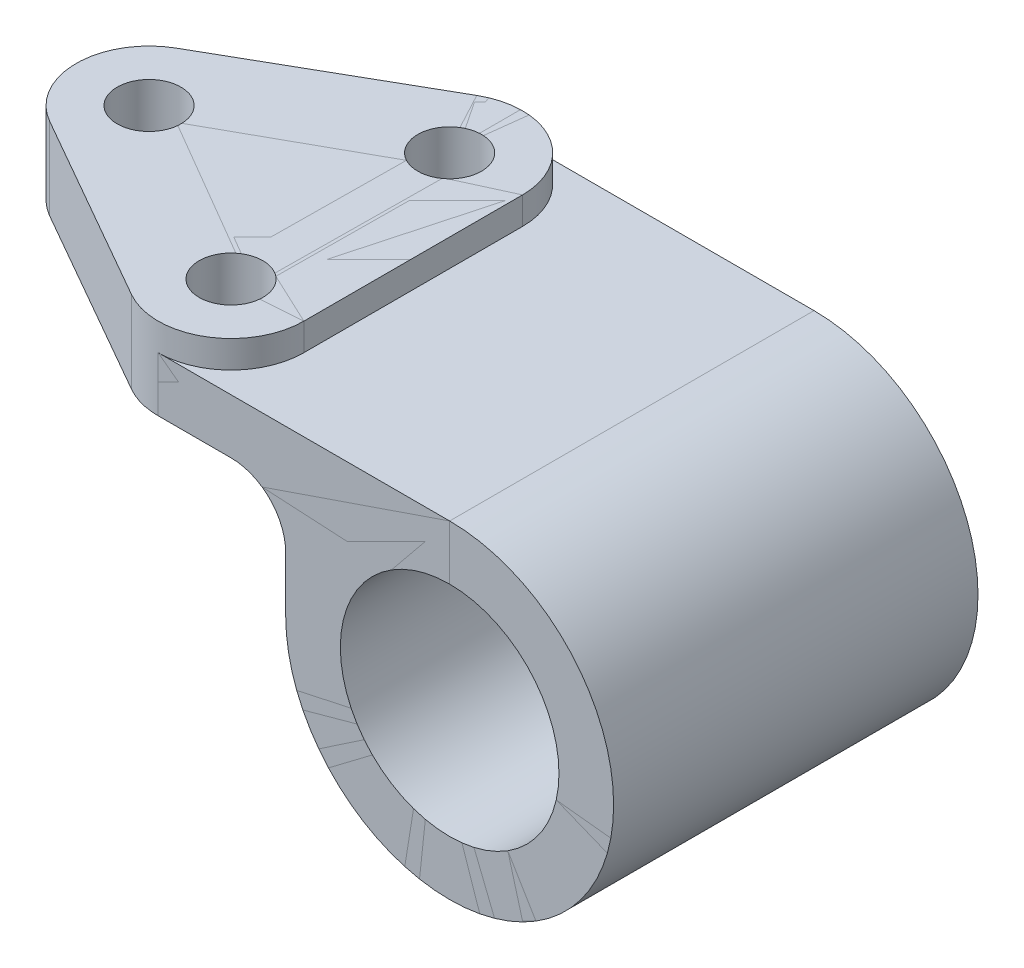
ISO-10303-21;
HEADER;
FILE_DESCRIPTION(('STEP AP214'),'2;1');
FILE_NAME('part.step','',(''),(''),'','','');
FILE_SCHEMA(('AUTOMOTIVE_DESIGN { 1 0 10303 214 1 1 1 1 }'));
ENDSEC;
DATA;
#1=APPLICATION_CONTEXT('core data for automotive mechanical design processes');
#2=APPLICATION_PROTOCOL_DEFINITION('international standard','automotive_design',2000,#1);
#3=PRODUCT_CONTEXT('',#1,'mechanical');
#4=PRODUCT('Part','Part','',(#3));
#5=PRODUCT_RELATED_PRODUCT_CATEGORY('part','',(#4));
#6=PRODUCT_DEFINITION_FORMATION('','',#4);
#7=PRODUCT_DEFINITION_CONTEXT('part definition',#1,'design');
#8=PRODUCT_DEFINITION('design','',#6,#7);
#9=PRODUCT_DEFINITION_SHAPE('','',#8);
#10=(LENGTH_UNIT() NAMED_UNIT(*) SI_UNIT(.MILLI.,.METRE.));
#11=(NAMED_UNIT(*) PLANE_ANGLE_UNIT() SI_UNIT($,.RADIAN.));
#12=(NAMED_UNIT(*) SI_UNIT($,.STERADIAN.) SOLID_ANGLE_UNIT());
#13=UNCERTAINTY_MEASURE_WITH_UNIT(LENGTH_MEASURE(1.E-05),#10,'distance_accuracy_value','');
#14=(GEOMETRIC_REPRESENTATION_CONTEXT(3) GLOBAL_UNCERTAINTY_ASSIGNED_CONTEXT((#13)) GLOBAL_UNIT_ASSIGNED_CONTEXT((#10,
#11,#12)) REPRESENTATION_CONTEXT('',''));
#15=CARTESIAN_POINT('',(0.,0.,0.));
#16=DIRECTION('',(0.,0.,1.));
#17=DIRECTION('',(1.,0.,0.));
#18=AXIS2_PLACEMENT_3D('',#15,#16,#17);
#19=CARTESIAN_POINT('',(-38.1,9.525,31.75));
#20=DIRECTION('',(0.,0.,-1.));
#21=DIRECTION('',(-1.,0.,0.));
#22=AXIS2_PLACEMENT_3D('',#19,#20,#21);
#23=PLANE('',#22);
#24=CARTESIAN_POINT('',(0.,0.,31.75));
#25=DIRECTION('',(0.,0.,1.));
#26=DIRECTION('',(1.,0.,0.));
#27=AXIS2_PLACEMENT_3D('',#24,#25,#26);
#28=CIRCLE('',#27,19.05);
#29=CARTESIAN_POINT('',(19.05,0.,31.75));
#30=VERTEX_POINT('',#29);
#31=EDGE_CURVE('E12',#30,#30,#28,.T.);
#32=ORIENTED_EDGE('',*,*,#31,.F.);
#33=EDGE_LOOP('',(#32));
#34=FACE_BOUND('',#33,.T.);
#35=DIRECTION('',(-1.,0.,0.));
#36=VECTOR('',#35,1.);
#37=CARTESIAN_POINT('',(-101.6,28.575,31.75));
#38=LINE('',#37,#36);
#39=CARTESIAN_POINT('',(0.,28.575,31.75));
#40=VERTEX_POINT('',#39);
#41=CARTESIAN_POINT('',(-50.8,28.575,31.75));
#42=VERTEX_POINT('',#41);
#43=EDGE_CURVE('E52',#40,#42,#38,.T.);
#44=ORIENTED_EDGE('',*,*,#43,.T.);
#45=DIRECTION('',(0.,1.,0.));
#46=VECTOR('',#45,1.);
#47=CARTESIAN_POINT('',(-50.8,-9.525,31.75));
#48=LINE('',#47,#46);
#49=CARTESIAN_POINT('',(-50.8,19.05,31.75));
#50=VERTEX_POINT('',#49);
#51=EDGE_CURVE('E62',#42,#50,#48,.F.);
#52=ORIENTED_EDGE('',*,*,#51,.T.);
#53=DIRECTION('',(1.,0.,0.));
#54=VECTOR('',#53,1.);
#55=CARTESIAN_POINT('',(-101.6,19.05,31.75));
#56=LINE('',#55,#54);
#57=CARTESIAN_POINT('',(-38.1000000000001,19.05,31.75));
#58=VERTEX_POINT('',#57);
#59=EDGE_CURVE('E88',#50,#58,#56,.T.);
#60=ORIENTED_EDGE('',*,*,#59,.T.);
#61=CARTESIAN_POINT('',(-38.1,9.525,31.75));
#62=DIRECTION('',(0.,0.,-1.));
#63=DIRECTION('',(-1.,0.,0.));
#64=AXIS2_PLACEMENT_3D('',#61,#62,#63);
#65=CIRCLE('',#64,9.525);
#66=CARTESIAN_POINT('',(-28.575,9.52499999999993,31.75));
#67=VERTEX_POINT('',#66);
#68=EDGE_CURVE('E83',#58,#67,#65,.T.);
#69=ORIENTED_EDGE('',*,*,#68,.T.);
#70=DIRECTION('',(0.,-1.,0.));
#71=VECTOR('',#70,1.);
#72=CARTESIAN_POINT('',(-28.575,9.52499999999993,31.75));
#73=LINE('',#72,#71);
#74=CARTESIAN_POINT('',(-28.575,0.,31.75));
#75=VERTEX_POINT('',#74);
#76=EDGE_CURVE('E77',#67,#75,#73,.T.);
#77=ORIENTED_EDGE('',*,*,#76,.T.);
#78=CARTESIAN_POINT('',(0.,0.,31.75));
#79=DIRECTION('',(0.,0.,1.));
#80=DIRECTION('',(1.,0.,0.));
#81=AXIS2_PLACEMENT_3D('',#78,#79,#80);
#82=CIRCLE('',#81,28.575);
#83=EDGE_CURVE('E75',#75,#40,#82,.T.);
#84=ORIENTED_EDGE('',*,*,#83,.T.);
#85=EDGE_LOOP('',(#44,#52,#60,#69,#77,#84));
#86=FACE_BOUND('',#85,.T.);
#87=ADVANCED_FACE('F47',(#34,#86),#23,.F.);
#88=OPEN_SHELL('',(#87));
#89=SHELL_BASED_SURFACE_MODEL('B2',(#88));
#90=CARTESIAN_POINT('',(-50.8,33.3375,-19.05));
#91=DIRECTION('',(0.,-1.,0.));
#92=DIRECTION('',(0.,0.,-1.));
#93=AXIS2_PLACEMENT_3D('',#90,#91,#92);
#94=PLANE('',#93);
#95=CARTESIAN_POINT('',(-84.1375,33.3375,0.));
#96=DIRECTION('',(0.,1.,0.));
#97=DIRECTION('',(0.,0.,1.));
#98=AXIS2_PLACEMENT_3D('',#95,#96,#97);
#99=CIRCLE('',#98,5.55625);
#100=CARTESIAN_POINT('',(-84.1375,33.3375,5.55625));
#101=VERTEX_POINT('',#100);
#102=EDGE_CURVE('E184',#101,#101,#99,.T.);
#103=ORIENTED_EDGE('',*,*,#102,.F.);
#104=EDGE_LOOP('',(#103));
#105=FACE_BOUND('',#104,.T.);
#106=CARTESIAN_POINT('',(-50.8,33.3375,-19.05));
#107=DIRECTION('',(0.,1.,0.));
#108=DIRECTION('',(0.,0.,1.));
#109=AXIS2_PLACEMENT_3D('',#106,#107,#108);
#110=CIRCLE('',#109,5.55625);
#111=CARTESIAN_POINT('',(-50.8,33.3375,-13.49375));
#112=VERTEX_POINT('',#111);
#113=EDGE_CURVE('E180',#112,#112,#110,.T.);
#114=ORIENTED_EDGE('',*,*,#113,.F.);
#115=EDGE_LOOP('',(#114));
#116=FACE_BOUND('',#115,.T.);
#117=CARTESIAN_POINT('',(-50.8,33.3375,19.05));
#118=DIRECTION('',(0.,1.,0.));
#119=DIRECTION('',(0.,0.,1.));
#120=AXIS2_PLACEMENT_3D('',#117,#118,#119);
#121=CIRCLE('',#120,5.55625);
#122=CARTESIAN_POINT('',(-50.8,33.3375,24.60625));
#123=VERTEX_POINT('',#122);
#124=EDGE_CURVE('E154',#123,#123,#121,.T.);
#125=ORIENTED_EDGE('',*,*,#124,.F.);
#126=EDGE_LOOP('',(#125));
#127=FACE_BOUND('',#126,.T.);
#128=CARTESIAN_POINT('',(-50.8,33.3375,-19.05));
#129=DIRECTION('',(0.,1.,0.));
#130=DIRECTION('',(0.,0.,-1.));
#131=AXIS2_PLACEMENT_3D('',#128,#129,#130);
#132=CIRCLE('',#131,12.7);
#133=CARTESIAN_POINT('',(-38.1,33.3375,-19.05));
#134=VERTEX_POINT('',#133);
#135=CARTESIAN_POINT('',(-57.1009645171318,33.3375,-30.0766879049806));
#136=VERTEX_POINT('',#135);
#137=EDGE_CURVE('E134',#134,#136,#132,.T.);
#138=ORIENTED_EDGE('',*,*,#137,.T.);
#139=DIRECTION('',(-0.868243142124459,0.,0.496138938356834));
#140=VECTOR('',#139,1.);
#141=CARTESIAN_POINT('',(-90.4384645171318,33.3375,-11.0266879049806));
#142=LINE('',#141,#140);
#143=CARTESIAN_POINT('',(-90.4384645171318,33.3375,-11.0266879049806));
#144=VERTEX_POINT('',#143);
#145=EDGE_CURVE('E151',#136,#144,#142,.T.);
#146=ORIENTED_EDGE('',*,*,#145,.T.);
#147=CARTESIAN_POINT('',(-84.1375,33.3375,0.));
#148=DIRECTION('',(0.,1.,0.));
#149=DIRECTION('',(0.,0.,1.));
#150=AXIS2_PLACEMENT_3D('',#147,#148,#149);
#151=CIRCLE('',#150,12.7);
#152=CARTESIAN_POINT('',(-90.4384645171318,33.3375,11.0266879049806));
#153=VERTEX_POINT('',#152);
#154=EDGE_CURVE('E157',#144,#153,#151,.T.);
#155=ORIENTED_EDGE('',*,*,#154,.T.);
#156=DIRECTION('',(0.868243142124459,0.,0.496138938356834));
#157=VECTOR('',#156,1.);
#158=CARTESIAN_POINT('',(-57.1009645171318,33.3375,30.0766879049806));
#159=LINE('',#158,#157);
#160=CARTESIAN_POINT('',(-57.1009645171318,33.3375,30.0766879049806));
#161=VERTEX_POINT('',#160);
#162=EDGE_CURVE('E162',#153,#161,#159,.T.);
#163=ORIENTED_EDGE('',*,*,#162,.T.);
#164=CARTESIAN_POINT('',(-50.8,33.3375,19.05));
#165=DIRECTION('',(0.,1.,0.));
#166=DIRECTION('',(0.,0.,1.));
#167=AXIS2_PLACEMENT_3D('',#164,#165,#166);
#168=CIRCLE('',#167,12.7);
#169=CARTESIAN_POINT('',(-38.1,33.3375,19.05));
#170=VERTEX_POINT('',#169);
#171=EDGE_CURVE('E130',#161,#170,#168,.T.);
#172=ORIENTED_EDGE('',*,*,#171,.T.);
#173=DIRECTION('',(0.,0.,-1.));
#174=VECTOR('',#173,1.);
#175=CARTESIAN_POINT('',(-38.1,33.3375,-19.05));
#176=LINE('',#175,#174);
#177=EDGE_CURVE('E45',#170,#134,#176,.T.);
#178=ORIENTED_EDGE('',*,*,#177,.T.);
#179=EDGE_LOOP('',(#138,#146,#155,#163,#172,#178));
#180=FACE_BOUND('',#179,.T.);
#181=ADVANCED_FACE('F125',(#105,#116,#127,#180),#94,.F.);
#182=OPEN_SHELL('',(#181));
#183=SHELL_BASED_SURFACE_MODEL('B6',(#182));
#184=CARTESIAN_POINT('',(-38.1,9.525,31.75));
#185=DIRECTION('',(0.,0.,-1.));
#186=DIRECTION('',(-1.,0.,0.));
#187=AXIS2_PLACEMENT_3D('',#184,#185,#186);
#188=CYLINDRICAL_SURFACE('',#187,9.525);
#189=CARTESIAN_POINT('',(-38.1,9.525,-31.75));
#190=DIRECTION('',(0.,0.,-1.));
#191=DIRECTION('',(-1.,0.,0.));
#192=AXIS2_PLACEMENT_3D('',#189,#190,#191);
#193=CIRCLE('',#192,9.525);
#194=CARTESIAN_POINT('',(-38.1000000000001,19.05,-31.75));
#195=VERTEX_POINT('',#194);
#196=CARTESIAN_POINT('',(-28.575,9.52499999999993,-31.75));
#197=VERTEX_POINT('',#196);
#198=EDGE_CURVE('E387',#195,#197,#193,.T.);
#199=ORIENTED_EDGE('',*,*,#198,.T.);
#200=DIRECTION('',(0.,0.,-1.));
#201=VECTOR('',#200,1.);
#202=CARTESIAN_POINT('',(-28.575,9.52499999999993,31.75));
#203=LINE('',#202,#201);
#204=CARTESIAN_POINT('',(-28.575,9.52499999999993,31.75));
#205=VERTEX_POINT('',#204);
#206=EDGE_CURVE('E319',#205,#197,#203,.T.);
#207=ORIENTED_EDGE('',*,*,#206,.F.);
#208=CARTESIAN_POINT('',(-38.1,9.525,31.75));
#209=DIRECTION('',(0.,0.,-1.));
#210=DIRECTION('',(-1.,0.,0.));
#211=AXIS2_PLACEMENT_3D('',#208,#209,#210);
#212=CIRCLE('',#211,9.525);
#213=CARTESIAN_POINT('',(-38.1000000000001,19.05,31.75));
#214=VERTEX_POINT('',#213);
#215=EDGE_CURVE('E336',#214,#205,#212,.T.);
#216=ORIENTED_EDGE('',*,*,#215,.F.);
#217=DIRECTION('',(0.,0.,-1.));
#218=VECTOR('',#217,1.);
#219=CARTESIAN_POINT('',(-38.1000000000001,19.05,31.75));
#220=LINE('',#219,#218);
#221=EDGE_CURVE('E342',#214,#195,#220,.T.);
#222=ORIENTED_EDGE('',*,*,#221,.T.);
#223=EDGE_LOOP('',(#199,#207,#216,#222));
#224=FACE_BOUND('',#223,.T.);
#225=ADVANCED_FACE('F210',(#224),#188,.F.);
#226=CARTESIAN_POINT('',(-28.575,9.52499999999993,31.75));
#227=DIRECTION('',(1.,0.,0.));
#228=DIRECTION('',(0.,0.,-1.));
#229=AXIS2_PLACEMENT_3D('',#226,#227,#228);
#230=PLANE('',#229);
#231=DIRECTION('',(0.,-1.,0.));
#232=VECTOR('',#231,1.);
#233=CARTESIAN_POINT('',(-28.575,9.52499999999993,-31.75));
#234=LINE('',#233,#232);
#235=CARTESIAN_POINT('',(-28.575,0.,-31.75));
#236=VERTEX_POINT('',#235);
#237=EDGE_CURVE('E338',#197,#236,#234,.T.);
#238=ORIENTED_EDGE('',*,*,#237,.T.);
#239=DIRECTION('',(0.,0.,-1.));
#240=VECTOR('',#239,1.);
#241=CARTESIAN_POINT('',(-28.575,0.,31.75));
#242=LINE('',#241,#240);
#243=CARTESIAN_POINT('',(-28.575,0.,31.75));
#244=VERTEX_POINT('',#243);
#245=EDGE_CURVE('E345',#244,#236,#242,.T.);
#246=ORIENTED_EDGE('',*,*,#245,.F.);
#247=DIRECTION('',(0.,-1.,0.));
#248=VECTOR('',#247,1.);
#249=CARTESIAN_POINT('',(-28.575,9.52499999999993,31.75));
#250=LINE('',#249,#248);
#251=EDGE_CURVE('E260',#205,#244,#250,.T.);
#252=ORIENTED_EDGE('',*,*,#251,.F.);
#253=ORIENTED_EDGE('',*,*,#206,.T.);
#254=EDGE_LOOP('',(#238,#246,#252,#253));
#255=FACE_BOUND('',#254,.T.);
#256=ADVANCED_FACE('F415',(#255),#230,.F.);
#257=CARTESIAN_POINT('',(0.,0.,31.75));
#258=DIRECTION('',(0.,0.,-1.));
#259=DIRECTION('',(-1.,0.,0.));
#260=AXIS2_PLACEMENT_3D('',#257,#258,#259);
#261=CYLINDRICAL_SURFACE('',#260,28.575);
#262=CARTESIAN_POINT('',(0.,0.,-31.75));
#263=DIRECTION('',(0.,0.,1.));
#264=DIRECTION('',(1.,0.,0.));
#265=AXIS2_PLACEMENT_3D('',#262,#263,#264);
#266=CIRCLE('',#265,28.575);
#267=CARTESIAN_POINT('',(0.,28.575,-31.75));
#268=VERTEX_POINT('',#267);
#269=EDGE_CURVE('E245',#236,#268,#266,.T.);
#270=ORIENTED_EDGE('',*,*,#269,.T.);
#271=DIRECTION('',(0.,0.,-1.));
#272=VECTOR('',#271,1.);
#273=CARTESIAN_POINT('',(0.,28.575,31.75));
#274=LINE('',#273,#272);
#275=CARTESIAN_POINT('',(0.,28.575,31.75));
#276=VERTEX_POINT('',#275);
#277=EDGE_CURVE('E334',#276,#268,#274,.T.);
#278=ORIENTED_EDGE('',*,*,#277,.F.);
#279=CARTESIAN_POINT('',(0.,0.,31.75));
#280=DIRECTION('',(0.,0.,1.));
#281=DIRECTION('',(1.,0.,0.));
#282=AXIS2_PLACEMENT_3D('',#279,#280,#281);
#283=CIRCLE('',#282,28.575);
#284=EDGE_CURVE('E408',#244,#276,#283,.T.);
#285=ORIENTED_EDGE('',*,*,#284,.F.);
#286=ORIENTED_EDGE('',*,*,#245,.T.);
#287=EDGE_LOOP('',(#270,#278,#285,#286));
#288=FACE_BOUND('',#287,.T.);
#289=ADVANCED_FACE('F418',(#288),#261,.T.);
#290=CARTESIAN_POINT('',(-101.6,28.575,31.75));
#291=DIRECTION('',(0.,-1.,0.));
#292=DIRECTION('',(0.,0.,-1.));
#293=AXIS2_PLACEMENT_3D('',#290,#291,#292);
#294=PLANE('',#293);
#295=DIRECTION('',(-1.,0.,0.));
#296=VECTOR('',#295,1.);
#297=CARTESIAN_POINT('',(-101.6,28.575,-31.75));
#298=LINE('',#297,#296);
#299=CARTESIAN_POINT('',(-50.8,28.575,-31.75));
#300=VERTEX_POINT('',#299);
#301=EDGE_CURVE('E314',#268,#300,#298,.T.);
#302=ORIENTED_EDGE('',*,*,#301,.T.);
#303=CARTESIAN_POINT('',(-50.8,28.575,-19.05));
#304=DIRECTION('',(0.,-1.,0.));
#305=DIRECTION('',(0.,0.,-1.));
#306=AXIS2_PLACEMENT_3D('',#303,#304,#305);
#307=CIRCLE('',#306,12.7);
#308=CARTESIAN_POINT('',(-38.1,28.575,-19.05));
#309=VERTEX_POINT('',#308);
#310=EDGE_CURVE('E323',#309,#300,#307,.F.);
#311=ORIENTED_EDGE('',*,*,#310,.F.);
#312=DIRECTION('',(0.,0.,-1.));
#313=VECTOR('',#312,1.);
#314=CARTESIAN_POINT('',(-38.1,28.575,-19.05));
#315=LINE('',#314,#313);
#316=CARTESIAN_POINT('',(-38.1,28.575,19.05));
#317=VERTEX_POINT('',#316);
#318=EDGE_CURVE('E373',#317,#309,#315,.T.);
#319=ORIENTED_EDGE('',*,*,#318,.F.);
#320=CARTESIAN_POINT('',(-50.8,28.575,19.05));
#321=DIRECTION('',(0.,-1.,0.));
#322=DIRECTION('',(0.,0.,-1.));
#323=AXIS2_PLACEMENT_3D('',#320,#321,#322);
#324=CIRCLE('',#323,12.7);
#325=CARTESIAN_POINT('',(-50.8,28.575,31.75));
#326=VERTEX_POINT('',#325);
#327=EDGE_CURVE('E398',#326,#317,#324,.F.);
#328=ORIENTED_EDGE('',*,*,#327,.F.);
#329=DIRECTION('',(-1.,0.,0.));
#330=VECTOR('',#329,1.);
#331=CARTESIAN_POINT('',(-101.6,28.575,31.75));
#332=LINE('',#331,#330);
#333=EDGE_CURVE('E410',#276,#326,#332,.T.);
#334=ORIENTED_EDGE('',*,*,#333,.F.);
#335=ORIENTED_EDGE('',*,*,#277,.T.);
#336=EDGE_LOOP('',(#302,#311,#319,#328,#334,#335));
#337=FACE_BOUND('',#336,.T.);
#338=ADVANCED_FACE('F332',(#337),#294,.F.);
#339=CARTESIAN_POINT('',(-101.6,19.05,31.75));
#340=DIRECTION('',(0.,1.,0.));
#341=DIRECTION('',(0.,0.,1.));
#342=AXIS2_PLACEMENT_3D('',#339,#340,#341);
#343=PLANE('',#342);
#344=CARTESIAN_POINT('',(-84.1375,19.05,0.));
#345=DIRECTION('',(0.,1.,0.));
#346=DIRECTION('',(0.,0.,1.));
#347=AXIS2_PLACEMENT_3D('',#344,#345,#346);
#348=CIRCLE('',#347,5.55625);
#349=CARTESIAN_POINT('',(-84.1375,19.05,5.55625));
#350=VERTEX_POINT('',#349);
#351=EDGE_CURVE('E475',#350,#350,#348,.T.);
#352=ORIENTED_EDGE('',*,*,#351,.T.);
#353=EDGE_LOOP('',(#352));
#354=FACE_BOUND('',#353,.T.);
#355=CARTESIAN_POINT('',(-50.8,19.05,-19.05));
#356=DIRECTION('',(0.,1.,0.));
#357=DIRECTION('',(0.,0.,1.));
#358=AXIS2_PLACEMENT_3D('',#355,#356,#357);
#359=CIRCLE('',#358,5.55625);
#360=CARTESIAN_POINT('',(-50.8,19.05,-13.49375));
#361=VERTEX_POINT('',#360);
#362=EDGE_CURVE('E481',#361,#361,#359,.T.);
#363=ORIENTED_EDGE('',*,*,#362,.T.);
#364=EDGE_LOOP('',(#363));
#365=FACE_BOUND('',#364,.T.);
#366=CARTESIAN_POINT('',(-50.8,19.05,19.05));
#367=DIRECTION('',(0.,1.,0.));
#368=DIRECTION('',(0.,0.,1.));
#369=AXIS2_PLACEMENT_3D('',#366,#367,#368);
#370=CIRCLE('',#369,5.55625);
#371=CARTESIAN_POINT('',(-50.8,19.05,24.60625));
#372=VERTEX_POINT('',#371);
#373=EDGE_CURVE('E376',#372,#372,#370,.T.);
#374=ORIENTED_EDGE('',*,*,#373,.T.);
#375=EDGE_LOOP('',(#374));
#376=FACE_BOUND('',#375,.T.);
#377=DIRECTION('',(1.,0.,0.));
#378=VECTOR('',#377,1.);
#379=CARTESIAN_POINT('',(-101.6,19.05,31.75));
#380=LINE('',#379,#378);
#381=CARTESIAN_POINT('',(-50.8,19.05,31.75));
#382=VERTEX_POINT('',#381);
#383=EDGE_CURVE('E226',#382,#214,#380,.T.);
#384=ORIENTED_EDGE('',*,*,#383,.F.);
#385=CARTESIAN_POINT('',(-50.8,19.05,19.05));
#386=DIRECTION('',(0.,1.,0.));
#387=DIRECTION('',(0.,0.,1.));
#388=AXIS2_PLACEMENT_3D('',#385,#386,#387);
#389=CIRCLE('',#388,12.7);
#390=CARTESIAN_POINT('',(-57.1009645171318,19.05,30.0766879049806));
#391=VERTEX_POINT('',#390);
#392=EDGE_CURVE('E330',#382,#391,#389,.F.);
#393=ORIENTED_EDGE('',*,*,#392,.T.);
#394=DIRECTION('',(-0.868243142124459,0.,-0.496138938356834));
#395=VECTOR('',#394,1.);
#396=CARTESIAN_POINT('',(-89.9255799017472,19.05,11.3197648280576));
#397=LINE('',#396,#395);
#398=CARTESIAN_POINT('',(-90.4384645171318,19.05,11.0266879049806));
#399=VERTEX_POINT('',#398);
#400=EDGE_CURVE('E123',#391,#399,#397,.T.);
#401=ORIENTED_EDGE('',*,*,#400,.T.);
#402=CARTESIAN_POINT('',(-84.1375,19.05,0.));
#403=DIRECTION('',(0.,1.,0.));
#404=DIRECTION('',(0.,0.,1.));
#405=AXIS2_PLACEMENT_3D('',#402,#403,#404);
#406=CIRCLE('',#405,12.7);
#407=CARTESIAN_POINT('',(-90.4384645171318,19.05,-11.0266879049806));
#408=VERTEX_POINT('',#407);
#409=EDGE_CURVE('E218',#399,#408,#406,.F.);
#410=ORIENTED_EDGE('',*,*,#409,.T.);
#411=DIRECTION('',(0.868243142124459,0.,-0.496138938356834));
#412=VECTOR('',#411,1.);
#413=CARTESIAN_POINT('',(-117.279426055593,19.05,4.3110044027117));
#414=LINE('',#413,#412);
#415=CARTESIAN_POINT('',(-57.1009645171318,19.05,-30.0766879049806));
#416=VERTEX_POINT('',#415);
#417=EDGE_CURVE('E349',#408,#416,#414,.T.);
#418=ORIENTED_EDGE('',*,*,#417,.T.);
#419=CARTESIAN_POINT('',(-50.8,19.05,-19.05));
#420=DIRECTION('',(0.,1.,0.));
#421=DIRECTION('',(0.,0.,1.));
#422=AXIS2_PLACEMENT_3D('',#419,#420,#421);
#423=CIRCLE('',#422,12.7);
#424=CARTESIAN_POINT('',(-50.8,19.05,-31.75));
#425=VERTEX_POINT('',#424);
#426=EDGE_CURVE('E375',#416,#425,#423,.F.);
#427=ORIENTED_EDGE('',*,*,#426,.T.);
#428=DIRECTION('',(1.,0.,0.));
#429=VECTOR('',#428,1.);
#430=CARTESIAN_POINT('',(-101.6,19.05,-31.75));
#431=LINE('',#430,#429);
#432=EDGE_CURVE('E252',#425,#195,#431,.T.);
#433=ORIENTED_EDGE('',*,*,#432,.T.);
#434=ORIENTED_EDGE('',*,*,#221,.F.);
#435=EDGE_LOOP('',(#384,#393,#401,#410,#418,#427,#433,#434));
#436=FACE_BOUND('',#435,.T.);
#437=ADVANCED_FACE('F353',(#354,#365,#376,#436),#343,.F.);
#438=CARTESIAN_POINT('',(-38.1,9.525,31.75));
#439=DIRECTION('',(0.,0.,-1.));
#440=DIRECTION('',(-1.,0.,0.));
#441=AXIS2_PLACEMENT_3D('',#438,#439,#440);
#442=PLANE('',#441);
#443=CARTESIAN_POINT('',(0.,0.,31.75));
#444=DIRECTION('',(0.,0.,1.));
#445=DIRECTION('',(1.,0.,0.));
#446=AXIS2_PLACEMENT_3D('',#443,#444,#445);
#447=CIRCLE('',#446,19.05);
#448=CARTESIAN_POINT('',(19.05,0.,31.75));
#449=VERTEX_POINT('',#448);
#450=EDGE_CURVE('E465',#449,#449,#447,.T.);
#451=ORIENTED_EDGE('',*,*,#450,.F.);
#452=EDGE_LOOP('',(#451));
#453=FACE_BOUND('',#452,.T.);
#454=ORIENTED_EDGE('',*,*,#333,.T.);
#455=DIRECTION('',(0.,1.,0.));
#456=VECTOR('',#455,1.);
#457=CARTESIAN_POINT('',(-50.8,-9.525,31.75));
#458=LINE('',#457,#456);
#459=EDGE_CURVE('E318',#326,#382,#458,.F.);
#460=ORIENTED_EDGE('',*,*,#459,.T.);
#461=ORIENTED_EDGE('',*,*,#383,.T.);
#462=ORIENTED_EDGE('',*,*,#215,.T.);
#463=ORIENTED_EDGE('',*,*,#251,.T.);
#464=ORIENTED_EDGE('',*,*,#284,.T.);
#465=EDGE_LOOP('',(#454,#460,#461,#462,#463,#464));
#466=FACE_BOUND('',#465,.T.);
#467=ADVANCED_FACE('F419',(#453,#466),#442,.F.);
#468=CARTESIAN_POINT('',(-38.1,9.525,-31.75));
#469=DIRECTION('',(0.,0.,-1.));
#470=DIRECTION('',(-1.,0.,0.));
#471=AXIS2_PLACEMENT_3D('',#468,#469,#470);
#472=PLANE('',#471);
#473=CARTESIAN_POINT('',(0.,0.,-31.75));
#474=DIRECTION('',(0.,0.,1.));
#475=DIRECTION('',(1.,0.,0.));
#476=AXIS2_PLACEMENT_3D('',#473,#474,#475);
#477=CIRCLE('',#476,19.05);
#478=CARTESIAN_POINT('',(19.05,0.,-31.75));
#479=VERTEX_POINT('',#478);
#480=EDGE_CURVE('E467',#479,#479,#477,.T.);
#481=ORIENTED_EDGE('',*,*,#480,.T.);
#482=EDGE_LOOP('',(#481));
#483=FACE_BOUND('',#482,.T.);
#484=DIRECTION('',(0.,1.,0.));
#485=VECTOR('',#484,1.);
#486=CARTESIAN_POINT('',(-50.8,-9.525,-31.75));
#487=LINE('',#486,#485);
#488=EDGE_CURVE('E310',#300,#425,#487,.F.);
#489=ORIENTED_EDGE('',*,*,#488,.F.);
#490=ORIENTED_EDGE('',*,*,#301,.F.);
#491=ORIENTED_EDGE('',*,*,#269,.F.);
#492=ORIENTED_EDGE('',*,*,#237,.F.);
#493=ORIENTED_EDGE('',*,*,#198,.F.);
#494=ORIENTED_EDGE('',*,*,#432,.F.);
#495=EDGE_LOOP('',(#489,#490,#491,#492,#493,#494));
#496=FACE_BOUND('',#495,.T.);
#497=ADVANCED_FACE('F312',(#483,#496),#472,.T.);
#498=CARTESIAN_POINT('',(-50.8,-28.576,-19.05));
#499=DIRECTION('',(0.,1.,0.));
#500=DIRECTION('',(0.,0.,1.));
#501=AXIS2_PLACEMENT_3D('',#498,#499,#500);
#502=CYLINDRICAL_SURFACE('',#501,12.7);
#503=ORIENTED_EDGE('',*,*,#310,.T.);
#504=ORIENTED_EDGE('',*,*,#488,.T.);
#505=ORIENTED_EDGE('',*,*,#426,.F.);
#506=DIRECTION('',(0.,1.,0.));
#507=VECTOR('',#506,1.);
#508=CARTESIAN_POINT('',(-57.1009645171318,-28.576,-30.0766879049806));
#509=LINE('',#508,#507);
#510=CARTESIAN_POINT('',(-57.1009645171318,33.3375,-30.0766879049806));
#511=VERTEX_POINT('',#510);
#512=EDGE_CURVE('E329',#416,#511,#509,.T.);
#513=ORIENTED_EDGE('',*,*,#512,.T.);
#514=CARTESIAN_POINT('',(-50.8,33.3375,-19.05));
#515=DIRECTION('',(0.,1.,0.));
#516=DIRECTION('',(0.,0.,-1.));
#517=AXIS2_PLACEMENT_3D('',#514,#515,#516);
#518=CIRCLE('',#517,12.7);
#519=CARTESIAN_POINT('',(-38.1,33.3375,-19.05));
#520=VERTEX_POINT('',#519);
#521=EDGE_CURVE('E368',#520,#511,#518,.T.);
#522=ORIENTED_EDGE('',*,*,#521,.F.);
#523=DIRECTION('',(0.,1.,0.));
#524=VECTOR('',#523,1.);
#525=CARTESIAN_POINT('',(-38.1,-28.576,-19.05));
#526=LINE('',#525,#524);
#527=EDGE_CURVE('E326',#309,#520,#526,.T.);
#528=ORIENTED_EDGE('',*,*,#527,.F.);
#529=EDGE_LOOP('',(#503,#504,#505,#513,#522,#528));
#530=FACE_BOUND('',#529,.T.);
#531=ADVANCED_FACE('F324',(#530),#502,.T.);
#532=CARTESIAN_POINT('',(-38.1,-28.576,-19.05));
#533=DIRECTION('',(1.,0.,0.));
#534=DIRECTION('',(0.,0.,-1.));
#535=AXIS2_PLACEMENT_3D('',#532,#533,#534);
#536=PLANE('',#535);
#537=DIRECTION('',(0.,1.,0.));
#538=VECTOR('',#537,1.);
#539=CARTESIAN_POINT('',(-38.1,-28.576,19.05));
#540=LINE('',#539,#538);
#541=CARTESIAN_POINT('',(-38.1,33.3375,19.05));
#542=VERTEX_POINT('',#541);
#543=EDGE_CURVE('E400',#317,#542,#540,.T.);
#544=ORIENTED_EDGE('',*,*,#543,.F.);
#545=ORIENTED_EDGE('',*,*,#318,.T.);
#546=ORIENTED_EDGE('',*,*,#527,.T.);
#547=DIRECTION('',(0.,0.,-1.));
#548=VECTOR('',#547,1.);
#549=CARTESIAN_POINT('',(-38.1,33.3375,-19.05));
#550=LINE('',#549,#548);
#551=EDGE_CURVE('E384',#542,#520,#550,.T.);
#552=ORIENTED_EDGE('',*,*,#551,.F.);
#553=EDGE_LOOP('',(#544,#545,#546,#552));
#554=FACE_BOUND('',#553,.T.);
#555=ADVANCED_FACE('F433',(#554),#536,.T.);
#556=CARTESIAN_POINT('',(-50.8,-28.576,19.05));
#557=DIRECTION('',(0.,1.,0.));
#558=DIRECTION('',(0.,0.,1.));
#559=AXIS2_PLACEMENT_3D('',#556,#557,#558);
#560=CYLINDRICAL_SURFACE('',#559,12.7);
#561=DIRECTION('',(0.,1.,0.));
#562=VECTOR('',#561,1.);
#563=CARTESIAN_POINT('',(-57.1009645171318,-28.576,30.0766879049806));
#564=LINE('',#563,#562);
#565=CARTESIAN_POINT('',(-57.1009645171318,33.3375,30.0766879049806));
#566=VERTEX_POINT('',#565);
#567=EDGE_CURVE('E403',#391,#566,#564,.T.);
#568=ORIENTED_EDGE('',*,*,#567,.F.);
#569=ORIENTED_EDGE('',*,*,#392,.F.);
#570=ORIENTED_EDGE('',*,*,#459,.F.);
#571=ORIENTED_EDGE('',*,*,#327,.T.);
#572=ORIENTED_EDGE('',*,*,#543,.T.);
#573=CARTESIAN_POINT('',(-50.8,33.3375,19.05));
#574=DIRECTION('',(0.,1.,0.));
#575=DIRECTION('',(0.,0.,1.));
#576=AXIS2_PLACEMENT_3D('',#573,#574,#575);
#577=CIRCLE('',#576,12.7);
#578=EDGE_CURVE('E388',#566,#542,#577,.T.);
#579=ORIENTED_EDGE('',*,*,#578,.F.);
#580=EDGE_LOOP('',(#568,#569,#570,#571,#572,#579));
#581=FACE_BOUND('',#580,.T.);
#582=ADVANCED_FACE('F423',(#581),#560,.T.);
#583=CARTESIAN_POINT('',(-57.1009645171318,-28.576,30.0766879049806));
#584=DIRECTION('',(-0.496138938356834,0.,0.868243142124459));
#585=DIRECTION('',(0.868243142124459,0.,0.496138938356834));
#586=AXIS2_PLACEMENT_3D('',#583,#584,#585);
#587=PLANE('',#586);
#588=DIRECTION('',(0.,1.,0.));
#589=VECTOR('',#588,1.);
#590=CARTESIAN_POINT('',(-90.4384645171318,-28.576,11.0266879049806));
#591=LINE('',#590,#589);
#592=CARTESIAN_POINT('',(-90.4384645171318,33.3375,11.0266879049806));
#593=VERTEX_POINT('',#592);
#594=EDGE_CURVE('E360',#399,#593,#591,.T.);
#595=ORIENTED_EDGE('',*,*,#594,.F.);
#596=ORIENTED_EDGE('',*,*,#400,.F.);
#597=ORIENTED_EDGE('',*,*,#567,.T.);
#598=DIRECTION('',(0.868243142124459,0.,0.496138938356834));
#599=VECTOR('',#598,1.);
#600=CARTESIAN_POINT('',(-57.1009645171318,33.3375,30.0766879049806));
#601=LINE('',#600,#599);
#602=EDGE_CURVE('E391',#593,#566,#601,.T.);
#603=ORIENTED_EDGE('',*,*,#602,.F.);
#604=EDGE_LOOP('',(#595,#596,#597,#603));
#605=FACE_BOUND('',#604,.T.);
#606=ADVANCED_FACE('F427',(#605),#587,.T.);
#607=CARTESIAN_POINT('',(-84.1375,-28.576,0.));
#608=DIRECTION('',(0.,1.,0.));
#609=DIRECTION('',(0.,0.,1.));
#610=AXIS2_PLACEMENT_3D('',#607,#608,#609);
#611=CYLINDRICAL_SURFACE('',#610,12.7);
#612=DIRECTION('',(0.,1.,0.));
#613=VECTOR('',#612,1.);
#614=CARTESIAN_POINT('',(-90.4384645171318,-28.576,-11.0266879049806));
#615=LINE('',#614,#613);
#616=CARTESIAN_POINT('',(-90.4384645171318,33.3375,-11.0266879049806));
#617=VERTEX_POINT('',#616);
#618=EDGE_CURVE('E362',#408,#617,#615,.T.);
#619=ORIENTED_EDGE('',*,*,#618,.F.);
#620=ORIENTED_EDGE('',*,*,#409,.F.);
#621=ORIENTED_EDGE('',*,*,#594,.T.);
#622=CARTESIAN_POINT('',(-84.1375,33.3375,0.));
#623=DIRECTION('',(0.,1.,0.));
#624=DIRECTION('',(0.,0.,1.));
#625=AXIS2_PLACEMENT_3D('',#622,#623,#624);
#626=CIRCLE('',#625,12.7);
#627=EDGE_CURVE('E364',#617,#593,#626,.T.);
#628=ORIENTED_EDGE('',*,*,#627,.F.);
#629=EDGE_LOOP('',(#619,#620,#621,#628));
#630=FACE_BOUND('',#629,.T.);
#631=ADVANCED_FACE('F358',(#630),#611,.T.);
#632=CARTESIAN_POINT('',(-90.4384645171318,-28.576,-11.0266879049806));
#633=DIRECTION('',(-0.496138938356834,0.,-0.868243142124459));
#634=DIRECTION('',(-0.868243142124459,0.,0.496138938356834));
#635=AXIS2_PLACEMENT_3D('',#632,#633,#634);
#636=PLANE('',#635);
#637=ORIENTED_EDGE('',*,*,#512,.F.);
#638=ORIENTED_EDGE('',*,*,#417,.F.);
#639=ORIENTED_EDGE('',*,*,#618,.T.);
#640=DIRECTION('',(-0.868243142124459,0.,0.496138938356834));
#641=VECTOR('',#640,1.);
#642=CARTESIAN_POINT('',(-90.4384645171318,33.3375,-11.0266879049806));
#643=LINE('',#642,#641);
#644=EDGE_CURVE('E371',#511,#617,#643,.T.);
#645=ORIENTED_EDGE('',*,*,#644,.F.);
#646=EDGE_LOOP('',(#637,#638,#639,#645));
#647=FACE_BOUND('',#646,.T.);
#648=ADVANCED_FACE('F370',(#647),#636,.T.);
#649=CARTESIAN_POINT('',(-50.8,33.3375,-19.05));
#650=DIRECTION('',(0.,-1.,0.));
#651=DIRECTION('',(0.,0.,-1.));
#652=AXIS2_PLACEMENT_3D('',#649,#650,#651);
#653=PLANE('',#652);
#654=CARTESIAN_POINT('',(-84.1375,33.3375,0.));
#655=DIRECTION('',(0.,1.,0.));
#656=DIRECTION('',(0.,0.,1.));
#657=AXIS2_PLACEMENT_3D('',#654,#655,#656);
#658=CIRCLE('',#657,5.55625);
#659=CARTESIAN_POINT('',(-84.1375,33.3375,5.55625));
#660=VERTEX_POINT('',#659);
#661=EDGE_CURVE('E470',#660,#660,#658,.T.);
#662=ORIENTED_EDGE('',*,*,#661,.F.);
#663=EDGE_LOOP('',(#662));
#664=FACE_BOUND('',#663,.T.);
#665=CARTESIAN_POINT('',(-50.8,33.3375,-19.05));
#666=DIRECTION('',(0.,1.,0.));
#667=DIRECTION('',(0.,0.,1.));
#668=AXIS2_PLACEMENT_3D('',#665,#666,#667);
#669=CIRCLE('',#668,5.55625);
#670=CARTESIAN_POINT('',(-50.8,33.3375,-13.49375));
#671=VERTEX_POINT('',#670);
#672=EDGE_CURVE('E478',#671,#671,#669,.T.);
#673=ORIENTED_EDGE('',*,*,#672,.F.);
#674=EDGE_LOOP('',(#673));
#675=FACE_BOUND('',#674,.T.);
#676=CARTESIAN_POINT('',(-50.8,33.3375,19.05));
#677=DIRECTION('',(0.,1.,0.));
#678=DIRECTION('',(0.,0.,1.));
#679=AXIS2_PLACEMENT_3D('',#676,#677,#678);
#680=CIRCLE('',#679,5.55625);
#681=CARTESIAN_POINT('',(-50.8,33.3375,24.60625));
#682=VERTEX_POINT('',#681);
#683=EDGE_CURVE('E380',#682,#682,#680,.T.);
#684=ORIENTED_EDGE('',*,*,#683,.F.);
#685=EDGE_LOOP('',(#684));
#686=FACE_BOUND('',#685,.T.);
#687=ORIENTED_EDGE('',*,*,#521,.T.);
#688=ORIENTED_EDGE('',*,*,#644,.T.);
#689=ORIENTED_EDGE('',*,*,#627,.T.);
#690=ORIENTED_EDGE('',*,*,#602,.T.);
#691=ORIENTED_EDGE('',*,*,#578,.T.);
#692=ORIENTED_EDGE('',*,*,#551,.T.);
#693=EDGE_LOOP('',(#687,#688,#689,#690,#691,#692));
#694=FACE_BOUND('',#693,.T.);
#695=ADVANCED_FACE('F429',(#664,#675,#686,#694),#653,.F.);
#696=CARTESIAN_POINT('',(-50.8,-28.575,19.05));
#697=DIRECTION('',(0.,1.,0.));
#698=DIRECTION('',(0.,0.,1.));
#699=AXIS2_PLACEMENT_3D('',#696,#697,#698);
#700=CYLINDRICAL_SURFACE('',#699,5.55625);
#701=ORIENTED_EDGE('',*,*,#683,.T.);
#702=EDGE_LOOP('',(#701));
#703=FACE_BOUND('',#702,.T.);
#704=ORIENTED_EDGE('',*,*,#373,.F.);
#705=EDGE_LOOP('',(#704));
#706=FACE_BOUND('',#705,.T.);
#707=ADVANCED_FACE('F486',(#703,#706),#700,.F.);
#708=CARTESIAN_POINT('',(-50.8,-28.575,-19.05));
#709=DIRECTION('',(0.,1.,0.));
#710=DIRECTION('',(0.,0.,1.));
#711=AXIS2_PLACEMENT_3D('',#708,#709,#710);
#712=CYLINDRICAL_SURFACE('',#711,5.55625);
#713=ORIENTED_EDGE('',*,*,#672,.T.);
#714=EDGE_LOOP('',(#713));
#715=FACE_BOUND('',#714,.T.);
#716=ORIENTED_EDGE('',*,*,#362,.F.);
#717=EDGE_LOOP('',(#716));
#718=FACE_BOUND('',#717,.T.);
#719=ADVANCED_FACE('F496',(#715,#718),#712,.F.);
#720=CARTESIAN_POINT('',(-84.1375,-28.575,0.));
#721=DIRECTION('',(0.,1.,0.));
#722=DIRECTION('',(0.,0.,1.));
#723=AXIS2_PLACEMENT_3D('',#720,#721,#722);
#724=CYLINDRICAL_SURFACE('',#723,5.55625);
#725=ORIENTED_EDGE('',*,*,#661,.T.);
#726=EDGE_LOOP('',(#725));
#727=FACE_BOUND('',#726,.T.);
#728=ORIENTED_EDGE('',*,*,#351,.F.);
#729=EDGE_LOOP('',(#728));
#730=FACE_BOUND('',#729,.T.);
#731=ADVANCED_FACE('F547',(#727,#730),#724,.F.);
#732=CARTESIAN_POINT('',(0.,0.,-31.75));
#733=DIRECTION('',(0.,0.,1.));
#734=DIRECTION('',(1.,0.,0.));
#735=AXIS2_PLACEMENT_3D('',#732,#733,#734);
#736=CYLINDRICAL_SURFACE('',#735,19.05);
#737=ORIENTED_EDGE('',*,*,#480,.F.);
#738=EDGE_LOOP('',(#737));
#739=FACE_BOUND('',#738,.T.);
#740=ORIENTED_EDGE('',*,*,#450,.T.);
#741=EDGE_LOOP('',(#740));
#742=FACE_BOUND('',#741,.T.);
#743=ADVANCED_FACE('F555',(#739,#742),#736,.F.);
#744=CLOSED_SHELL('',(#225,#256,#289,#338,#437,#467,#497,#531,#555,#582,#606,#631,#648,#695,
#707,#719,#731,#743));
#745=MANIFOLD_SOLID_BREP('B39',#744);
#746=ADVANCED_BREP_SHAPE_REPRESENTATION('',(#18,#745),#14);
#747=MANIFOLD_SURFACE_SHAPE_REPRESENTATION('',(#18,#89,#183),#14);
#748=SHAPE_REPRESENTATION('',(#18),#14);
#749=SHAPE_DEFINITION_REPRESENTATION(#9,#748);
#750=SHAPE_REPRESENTATION_RELATIONSHIP('','',#748,#746);
#751=SHAPE_REPRESENTATION_RELATIONSHIP('','',#748,#747);
ENDSEC;
END-ISO-10303-21;
